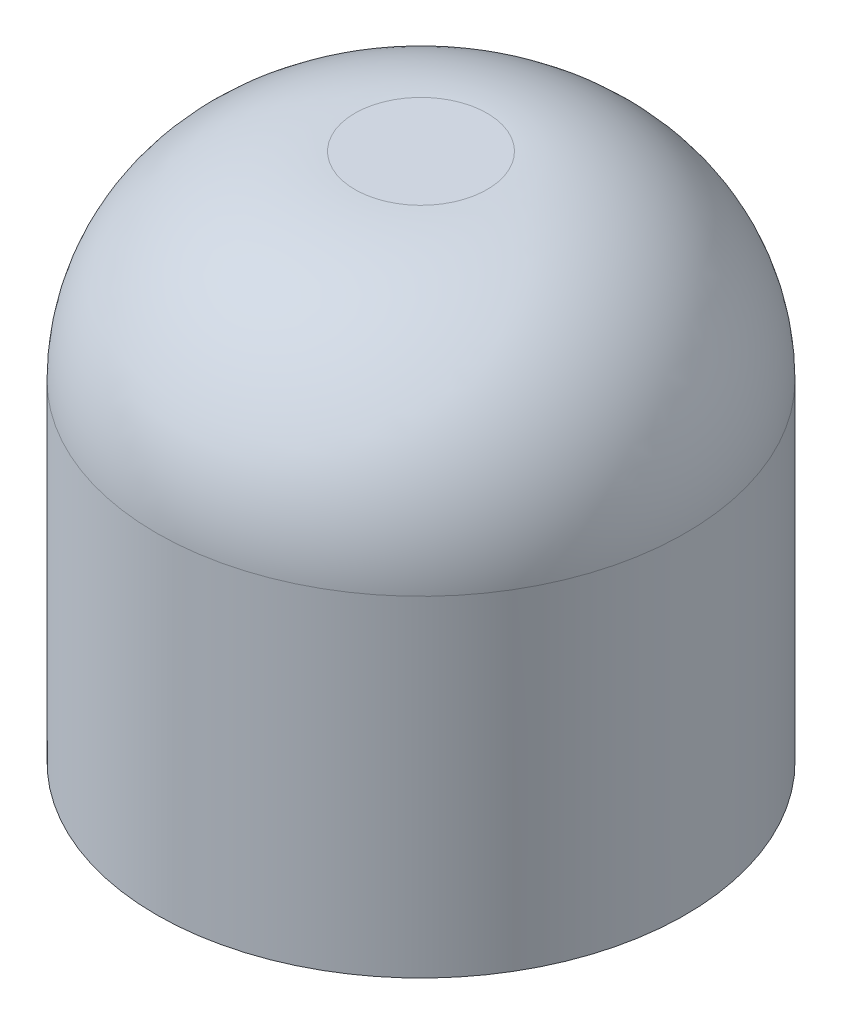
ISO-10303-21;
HEADER;
FILE_DESCRIPTION(('STEP AP214'),'2;1');
FILE_NAME('part.step','',(''),(''),'','','');
FILE_SCHEMA(('AUTOMOTIVE_DESIGN { 1 0 10303 214 1 1 1 1 }'));
ENDSEC;
DATA;
#1=APPLICATION_CONTEXT('core data for automotive mechanical design processes');
#2=APPLICATION_PROTOCOL_DEFINITION('international standard','automotive_design',2000,#1);
#3=PRODUCT_CONTEXT('',#1,'mechanical');
#4=PRODUCT('Part','Part','',(#3));
#5=PRODUCT_RELATED_PRODUCT_CATEGORY('part','',(#4));
#6=PRODUCT_DEFINITION_FORMATION('','',#4);
#7=PRODUCT_DEFINITION_CONTEXT('part definition',#1,'design');
#8=PRODUCT_DEFINITION('design','',#6,#7);
#9=PRODUCT_DEFINITION_SHAPE('','',#8);
#10=(LENGTH_UNIT() NAMED_UNIT(*) SI_UNIT(.MILLI.,.METRE.));
#11=(NAMED_UNIT(*) PLANE_ANGLE_UNIT() SI_UNIT($,.RADIAN.));
#12=(NAMED_UNIT(*) SI_UNIT($,.STERADIAN.) SOLID_ANGLE_UNIT());
#13=UNCERTAINTY_MEASURE_WITH_UNIT(LENGTH_MEASURE(1.E-05),#10,'distance_accuracy_value','');
#14=(GEOMETRIC_REPRESENTATION_CONTEXT(3) GLOBAL_UNCERTAINTY_ASSIGNED_CONTEXT((#13)) GLOBAL_UNIT_ASSIGNED_CONTEXT((#10,
#11,#12)) REPRESENTATION_CONTEXT('',''));
#15=CARTESIAN_POINT('',(0.,0.,0.));
#16=DIRECTION('',(0.,0.,1.));
#17=DIRECTION('',(1.,0.,0.));
#18=AXIS2_PLACEMENT_3D('',#15,#16,#17);
#19=CARTESIAN_POINT('',(0.,4.,0.));
#20=DIRECTION('',(0.,1.,0.));
#21=DIRECTION('',(0.,0.,1.));
#22=AXIS2_PLACEMENT_3D('',#19,#20,#21);
#23=PLANE('',#22);
#24=CARTESIAN_POINT('',(1.41691855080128E-13,4.00000000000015,-5.14787813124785E-13));
#25=DIRECTION('',(0.,1.,0.));
#26=DIRECTION('',(-1.,0.,0.));
#27=AXIS2_PLACEMENT_3D('',#24,#25,#26);
#28=CIRCLE('',#27,0.500000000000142);
#29=CARTESIAN_POINT('',(-0.5,4.00000000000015,-5.14787813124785E-13));
#30=VERTEX_POINT('',#29);
#31=EDGE_CURVE('E18',#30,#30,#28,.F.);
#32=ORIENTED_EDGE('',*,*,#31,.F.);
#33=EDGE_LOOP('',(#32));
#34=FACE_BOUND('',#33,.T.);
#35=ADVANCED_FACE('F14',(#34),#23,.T.);
#36=CARTESIAN_POINT('',(0.,0.,0.));
#37=DIRECTION('',(0.,1.,0.));
#38=DIRECTION('',(0.,0.,1.));
#39=AXIS2_PLACEMENT_3D('',#36,#37,#38);
#40=PLANE('',#39);
#41=CARTESIAN_POINT('',(0.,0.,0.));
#42=DIRECTION('',(0.,1.,0.));
#43=DIRECTION('',(0.,0.,1.));
#44=AXIS2_PLACEMENT_3D('',#41,#42,#43);
#45=CIRCLE('',#44,2.);
#46=CARTESIAN_POINT('',(0.,0.,2.));
#47=VERTEX_POINT('',#46);
#48=EDGE_CURVE('E22',#47,#47,#45,.T.);
#49=ORIENTED_EDGE('',*,*,#48,.F.);
#50=EDGE_LOOP('',(#49));
#51=FACE_BOUND('',#50,.T.);
#52=ADVANCED_FACE('F34',(#51),#40,.F.);
#53=CARTESIAN_POINT('',(1.41163122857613E-13,2.5000000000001,-5.14291300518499E-13));
#54=DIRECTION('',(0.,1.,0.));
#55=DIRECTION('',(-1.,0.,0.));
#56=AXIS2_PLACEMENT_3D('',#53,#54,#55);
#57=DEGENERATE_TOROIDAL_SURFACE('',#56,0.499999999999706,1.50000000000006,.T.);
#58=CARTESIAN_POINT('',(0.,2.5,0.));
#59=DIRECTION('',(0.,1.,0.));
#60=DIRECTION('',(0.,0.,1.));
#61=AXIS2_PLACEMENT_3D('',#58,#59,#60);
#62=CIRCLE('',#61,2.);
#63=CARTESIAN_POINT('',(0.,2.5,2.));
#64=VERTEX_POINT('',#63);
#65=EDGE_CURVE('E9',#64,#64,#62,.F.);
#66=ORIENTED_EDGE('',*,*,#65,.F.);
#67=EDGE_LOOP('',(#66));
#68=FACE_BOUND('',#67,.T.);
#69=ORIENTED_EDGE('',*,*,#31,.T.);
#70=EDGE_LOOP('',(#69));
#71=FACE_BOUND('',#70,.T.);
#72=ADVANCED_FACE('F16',(#68,#71),#57,.T.);
#73=CARTESIAN_POINT('',(0.,0.,0.));
#74=DIRECTION('',(0.,1.,0.));
#75=DIRECTION('',(0.,0.,1.));
#76=AXIS2_PLACEMENT_3D('',#73,#74,#75);
#77=CYLINDRICAL_SURFACE('',#76,2.);
#78=ORIENTED_EDGE('',*,*,#48,.T.);
#79=EDGE_LOOP('',(#78));
#80=FACE_BOUND('',#79,.T.);
#81=ORIENTED_EDGE('',*,*,#65,.T.);
#82=EDGE_LOOP('',(#81));
#83=FACE_BOUND('',#82,.T.);
#84=ADVANCED_FACE('F41',(#80,#83),#77,.T.);
#85=CLOSED_SHELL('',(#35,#52,#72,#84));
#86=MANIFOLD_SOLID_BREP('B1',#85);
#87=ADVANCED_BREP_SHAPE_REPRESENTATION('',(#18,#86),#14);
#88=SHAPE_DEFINITION_REPRESENTATION(#9,#87);
ENDSEC;
END-ISO-10303-21;
